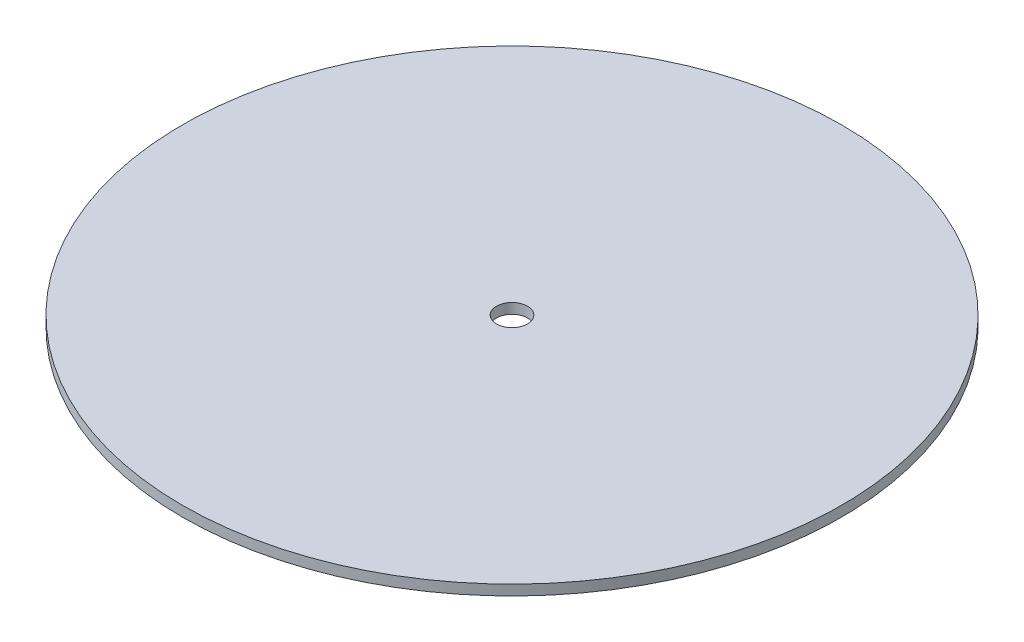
from build123d import *

# Parameters (mm, degrees)
SKETCH1_R      = 203.2
SKETCH1_R_2    = 9.525
EXTRUDE1_DEPTH = 6.35


with BuildPart() as part:
    # Sketch1 → Extrude1 (new body)
    with BuildSketch(Plane(origin=(0, 0, 0), x_dir=(1, 0, 0), z_dir=(0, 1, 0))):
        with Locations(Location((0, 0, 0), (0, 0, 270))):
            Circle(SKETCH1_R)
        with Locations(Location((0, 0, 0), (0, 0, 270))):
            Circle(SKETCH1_R_2, mode=Mode.SUBTRACT)
    extrude(amount=-EXTRUDE1_DEPTH)


solid = part.part
